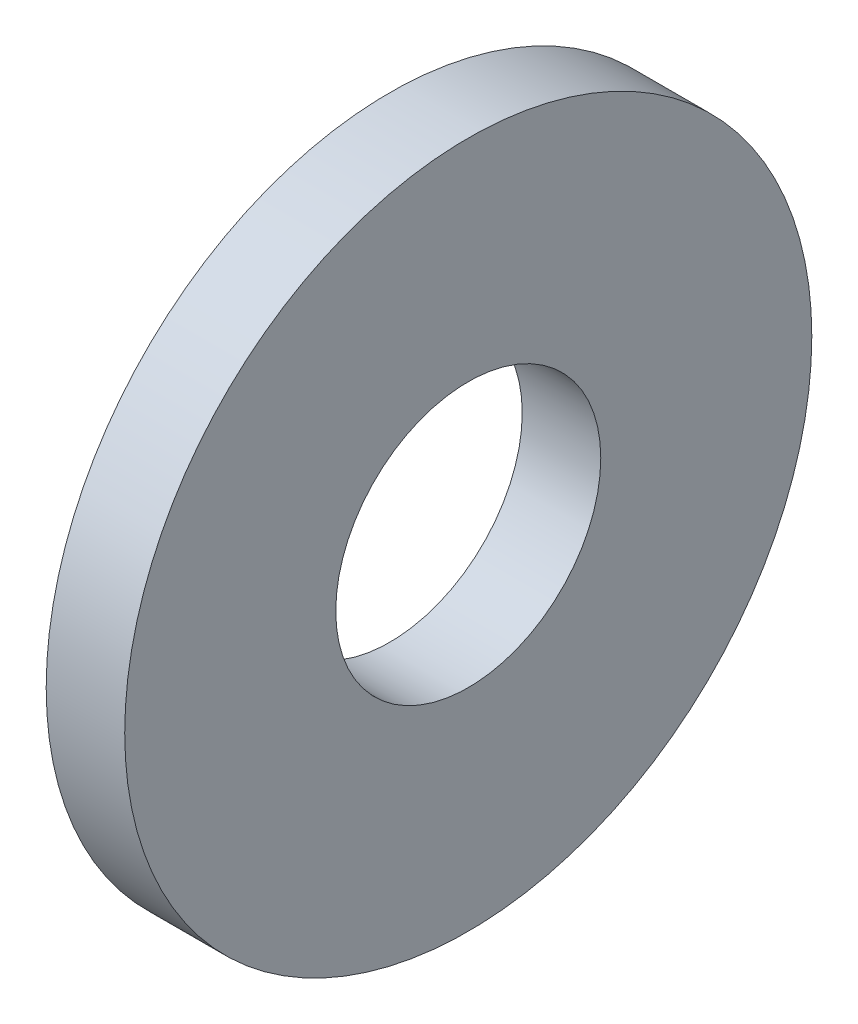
from build123d import *

# Parameters (mm, degrees)
SKETCH1_R          = 7
SKETCH1_R_2        = 2.7
BASE_EXTRUDE_DEPTH = 1.6


with BuildPart() as part:
    # Sketch1 → Base-Extrude (new body)
    with BuildSketch(Plane(origin=(0, 0, 0), x_dir=(0, 0, -1), z_dir=(1, 0, 0))):
        Circle(SKETCH1_R)
        Circle(SKETCH1_R_2, mode=Mode.SUBTRACT)
    extrude(amount=BASE_EXTRUDE_DEPTH)


solid = part.part
